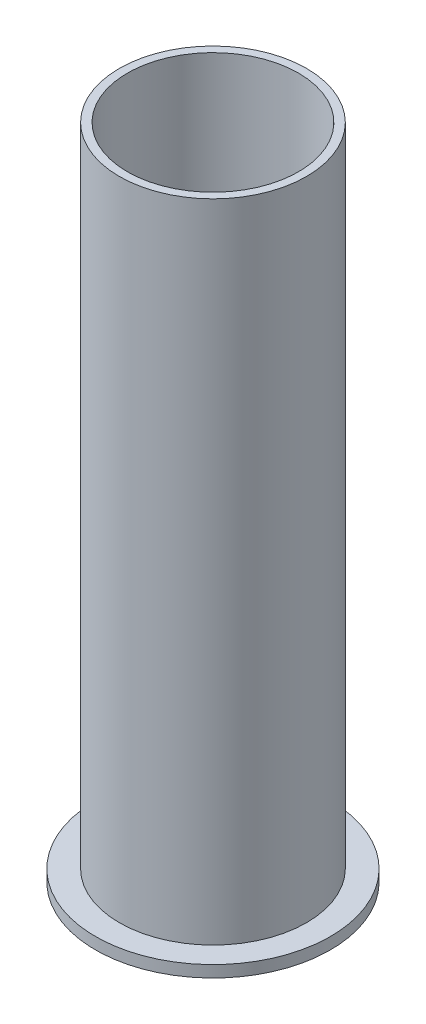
ISO-10303-21;
HEADER;
FILE_DESCRIPTION(('STEP AP214'),'2;1');
FILE_NAME('part.step','',(''),(''),'','','');
FILE_SCHEMA(('AUTOMOTIVE_DESIGN { 1 0 10303 214 1 1 1 1 }'));
ENDSEC;
DATA;
#1=APPLICATION_CONTEXT('core data for automotive mechanical design processes');
#2=APPLICATION_PROTOCOL_DEFINITION('international standard','automotive_design',2000,#1);
#3=PRODUCT_CONTEXT('',#1,'mechanical');
#4=PRODUCT('Part','Part','',(#3));
#5=PRODUCT_RELATED_PRODUCT_CATEGORY('part','',(#4));
#6=PRODUCT_DEFINITION_FORMATION('','',#4);
#7=PRODUCT_DEFINITION_CONTEXT('part definition',#1,'design');
#8=PRODUCT_DEFINITION('design','',#6,#7);
#9=PRODUCT_DEFINITION_SHAPE('','',#8);
#10=(LENGTH_UNIT() NAMED_UNIT(*) SI_UNIT(.MILLI.,.METRE.));
#11=(NAMED_UNIT(*) PLANE_ANGLE_UNIT() SI_UNIT($,.RADIAN.));
#12=(NAMED_UNIT(*) SI_UNIT($,.STERADIAN.) SOLID_ANGLE_UNIT());
#13=UNCERTAINTY_MEASURE_WITH_UNIT(LENGTH_MEASURE(1.E-05),#10,'distance_accuracy_value','');
#14=(GEOMETRIC_REPRESENTATION_CONTEXT(3) GLOBAL_UNCERTAINTY_ASSIGNED_CONTEXT((#13)) GLOBAL_UNIT_ASSIGNED_CONTEXT((#10,
#11,#12)) REPRESENTATION_CONTEXT('',''));
#15=CARTESIAN_POINT('',(0.,0.,0.));
#16=DIRECTION('',(0.,0.,1.));
#17=DIRECTION('',(1.,0.,0.));
#18=AXIS2_PLACEMENT_3D('',#15,#16,#17);
#19=CARTESIAN_POINT('',(0.,44.45,0.));
#20=DIRECTION('',(0.,-1.,0.));
#21=DIRECTION('',(0.,0.,-1.));
#22=AXIS2_PLACEMENT_3D('',#19,#20,#21);
#23=CYLINDRICAL_SURFACE('',#22,6.3246);
#24=CARTESIAN_POINT('',(0.,44.45,0.));
#25=DIRECTION('',(0.,1.,0.));
#26=DIRECTION('',(0.,0.,1.));
#27=AXIS2_PLACEMENT_3D('',#24,#25,#26);
#28=CIRCLE('',#27,6.3246);
#29=CARTESIAN_POINT('',(0.,44.45,6.3246));
#30=VERTEX_POINT('',#29);
#31=EDGE_CURVE('E34',#30,#30,#28,.T.);
#32=ORIENTED_EDGE('',*,*,#31,.F.);
#33=EDGE_LOOP('',(#32));
#34=FACE_BOUND('',#33,.T.);
#35=CARTESIAN_POINT('',(0.,0.787400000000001,0.));
#36=DIRECTION('',(0.,-1.,0.));
#37=DIRECTION('',(0.,0.,-1.));
#38=AXIS2_PLACEMENT_3D('',#35,#36,#37);
#39=CIRCLE('',#38,6.3246);
#40=CARTESIAN_POINT('',(0.,0.787400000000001,-6.3246));
#41=VERTEX_POINT('',#40);
#42=EDGE_CURVE('E10',#41,#41,#39,.T.);
#43=ORIENTED_EDGE('',*,*,#42,.F.);
#44=EDGE_LOOP('',(#43));
#45=FACE_BOUND('',#44,.T.);
#46=ADVANCED_FACE('F31',(#34,#45),#23,.T.);
#47=CARTESIAN_POINT('',(0.,44.45,0.));
#48=DIRECTION('',(0.,1.,0.));
#49=DIRECTION('',(0.,0.,1.));
#50=AXIS2_PLACEMENT_3D('',#47,#48,#49);
#51=PLANE('',#50);
#52=ORIENTED_EDGE('',*,*,#31,.T.);
#53=EDGE_LOOP('',(#52));
#54=FACE_BOUND('',#53,.T.);
#55=CARTESIAN_POINT('',(0.,44.45,0.));
#56=DIRECTION('',(0.,1.,0.));
#57=DIRECTION('',(0.,0.,1.));
#58=AXIS2_PLACEMENT_3D('',#55,#56,#57);
#59=CIRCLE('',#58,5.7785);
#60=CARTESIAN_POINT('',(0.,44.45,5.7785));
#61=VERTEX_POINT('',#60);
#62=EDGE_CURVE('E42',#61,#61,#59,.T.);
#63=ORIENTED_EDGE('',*,*,#62,.F.);
#64=EDGE_LOOP('',(#63));
#65=FACE_BOUND('',#64,.T.);
#66=ADVANCED_FACE('F73',(#54,#65),#51,.T.);
#67=CARTESIAN_POINT('',(0.,0.,0.));
#68=DIRECTION('',(0.,1.,0.));
#69=DIRECTION('',(0.,0.,1.));
#70=AXIS2_PLACEMENT_3D('',#67,#68,#69);
#71=PLANE('',#70);
#72=CARTESIAN_POINT('',(0.,0.,0.));
#73=DIRECTION('',(0.,1.,0.));
#74=DIRECTION('',(0.,0.,1.));
#75=AXIS2_PLACEMENT_3D('',#72,#73,#74);
#76=CIRCLE('',#75,5.7785);
#77=CARTESIAN_POINT('',(0.,0.,5.7785));
#78=VERTEX_POINT('',#77);
#79=EDGE_CURVE('E48',#78,#78,#76,.T.);
#80=ORIENTED_EDGE('',*,*,#79,.T.);
#81=EDGE_LOOP('',(#80));
#82=FACE_BOUND('',#81,.T.);
#83=CARTESIAN_POINT('',(0.,0.,0.));
#84=DIRECTION('',(0.,-1.,0.));
#85=DIRECTION('',(0.,0.,-1.));
#86=AXIS2_PLACEMENT_3D('',#83,#84,#85);
#87=CIRCLE('',#86,7.9375);
#88=CARTESIAN_POINT('',(0.,0.,-7.9375));
#89=VERTEX_POINT('',#88);
#90=EDGE_CURVE('E45',#89,#89,#87,.T.);
#91=ORIENTED_EDGE('',*,*,#90,.T.);
#92=EDGE_LOOP('',(#91));
#93=FACE_BOUND('',#92,.T.);
#94=ADVANCED_FACE('F59',(#82,#93),#71,.F.);
#95=CARTESIAN_POINT('',(0.,44.45,0.));
#96=DIRECTION('',(0.,-1.,0.));
#97=DIRECTION('',(0.,0.,-1.));
#98=AXIS2_PLACEMENT_3D('',#95,#96,#97);
#99=CYLINDRICAL_SURFACE('',#98,5.7785);
#100=ORIENTED_EDGE('',*,*,#79,.F.);
#101=EDGE_LOOP('',(#100));
#102=FACE_BOUND('',#101,.T.);
#103=ORIENTED_EDGE('',*,*,#62,.T.);
#104=EDGE_LOOP('',(#103));
#105=FACE_BOUND('',#104,.T.);
#106=ADVANCED_FACE('F68',(#102,#105),#99,.F.);
#107=CARTESIAN_POINT('',(0.,0.7874,0.));
#108=DIRECTION('',(0.,-1.,0.));
#109=DIRECTION('',(0.,0.,-1.));
#110=AXIS2_PLACEMENT_3D('',#107,#108,#109);
#111=PLANE('',#110);
#112=CARTESIAN_POINT('',(0.,0.7874,0.));
#113=DIRECTION('',(0.,-1.,0.));
#114=DIRECTION('',(0.,0.,-1.));
#115=AXIS2_PLACEMENT_3D('',#112,#113,#114);
#116=CIRCLE('',#115,7.9375);
#117=CARTESIAN_POINT('',(0.,0.7874,-7.9375));
#118=VERTEX_POINT('',#117);
#119=EDGE_CURVE('E50',#118,#118,#116,.T.);
#120=ORIENTED_EDGE('',*,*,#119,.F.);
#121=EDGE_LOOP('',(#120));
#122=FACE_BOUND('',#121,.T.);
#123=ORIENTED_EDGE('',*,*,#42,.T.);
#124=EDGE_LOOP('',(#123));
#125=FACE_BOUND('',#124,.T.);
#126=ADVANCED_FACE('F63',(#122,#125),#111,.F.);
#127=CARTESIAN_POINT('',(0.,0.7874,0.));
#128=DIRECTION('',(0.,-1.,0.));
#129=DIRECTION('',(0.,0.,-1.));
#130=AXIS2_PLACEMENT_3D('',#127,#128,#129);
#131=CYLINDRICAL_SURFACE('',#130,7.9375);
#132=ORIENTED_EDGE('',*,*,#119,.T.);
#133=EDGE_LOOP('',(#132));
#134=FACE_BOUND('',#133,.T.);
#135=ORIENTED_EDGE('',*,*,#90,.F.);
#136=EDGE_LOOP('',(#135));
#137=FACE_BOUND('',#136,.T.);
#138=ADVANCED_FACE('F61',(#134,#137),#131,.T.);
#139=CLOSED_SHELL('',(#46,#66,#94,#106,#126,#138));
#140=MANIFOLD_SOLID_BREP('B2',#139);
#141=ADVANCED_BREP_SHAPE_REPRESENTATION('',(#18,#140),#14);
#142=SHAPE_DEFINITION_REPRESENTATION(#9,#141);
ENDSEC;
END-ISO-10303-21;
